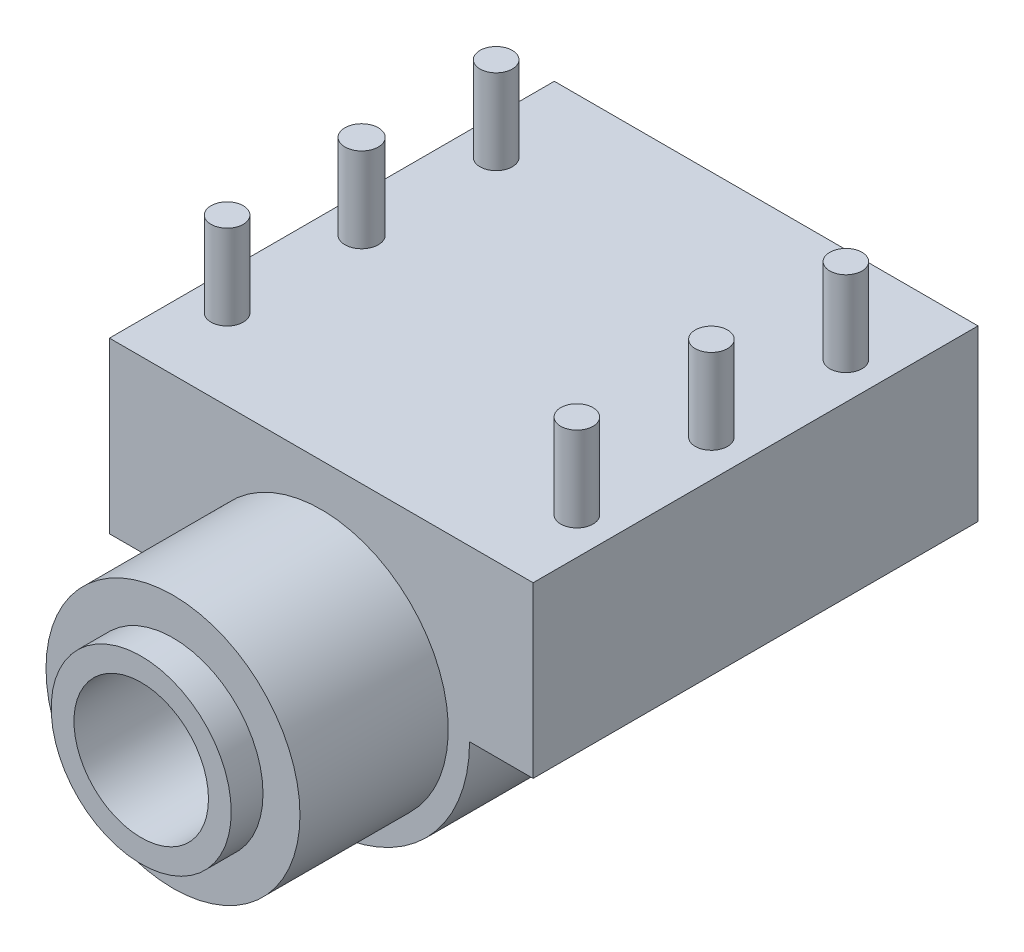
ISO-10303-21;
HEADER;
FILE_DESCRIPTION(('STEP AP214'),'2;1');
FILE_NAME('part.step','',(''),(''),'','','');
FILE_SCHEMA(('AUTOMOTIVE_DESIGN { 1 0 10303 214 1 1 1 1 }'));
ENDSEC;
DATA;
#1=APPLICATION_CONTEXT('core data for automotive mechanical design processes');
#2=APPLICATION_PROTOCOL_DEFINITION('international standard','automotive_design',2000,#1);
#3=PRODUCT_CONTEXT('',#1,'mechanical');
#4=PRODUCT('Part','Part','',(#3));
#5=PRODUCT_RELATED_PRODUCT_CATEGORY('part','',(#4));
#6=PRODUCT_DEFINITION_FORMATION('','',#4);
#7=PRODUCT_DEFINITION_CONTEXT('part definition',#1,'design');
#8=PRODUCT_DEFINITION('design','',#6,#7);
#9=PRODUCT_DEFINITION_SHAPE('','',#8);
#10=(LENGTH_UNIT() NAMED_UNIT(*) SI_UNIT(.MILLI.,.METRE.));
#11=(NAMED_UNIT(*) PLANE_ANGLE_UNIT() SI_UNIT($,.RADIAN.));
#12=(NAMED_UNIT(*) SI_UNIT($,.STERADIAN.) SOLID_ANGLE_UNIT());
#13=UNCERTAINTY_MEASURE_WITH_UNIT(LENGTH_MEASURE(1.E-05),#10,'distance_accuracy_value','');
#14=(GEOMETRIC_REPRESENTATION_CONTEXT(3) GLOBAL_UNCERTAINTY_ASSIGNED_CONTEXT((#13)) GLOBAL_UNIT_ASSIGNED_CONTEXT((#10,
#11,#12)) REPRESENTATION_CONTEXT('',''));
#15=CARTESIAN_POINT('',(0.,0.,0.));
#16=DIRECTION('',(0.,0.,1.));
#17=DIRECTION('',(1.,0.,0.));
#18=AXIS2_PLACEMENT_3D('',#15,#16,#17);
#19=CARTESIAN_POINT('',(0.,0.,7.));
#20=DIRECTION('',(0.,0.,1.));
#21=DIRECTION('',(1.,0.,0.));
#22=AXIS2_PLACEMENT_3D('',#19,#20,#21);
#23=PLANE('',#22);
#24=CARTESIAN_POINT('',(0.,0.,7.));
#25=DIRECTION('',(0.,0.,1.));
#26=DIRECTION('',(1.,0.,0.));
#27=AXIS2_PLACEMENT_3D('',#24,#25,#26);
#28=CIRCLE('',#27,5.9944);
#29=CARTESIAN_POINT('',(5.9944,0.,7.));
#30=VERTEX_POINT('',#29);
#31=EDGE_CURVE('E145',#30,#30,#28,.T.);
#32=ORIENTED_EDGE('',*,*,#31,.T.);
#33=EDGE_LOOP('',(#32));
#34=FACE_BOUND('',#33,.T.);
#35=CARTESIAN_POINT('',(0.,0.,7.));
#36=DIRECTION('',(0.,0.,1.));
#37=DIRECTION('',(1.,0.,0.));
#38=AXIS2_PLACEMENT_3D('',#35,#36,#37);
#39=CIRCLE('',#38,4.25);
#40=CARTESIAN_POINT('',(4.25,0.,7.));
#41=VERTEX_POINT('',#40);
#42=EDGE_CURVE('E275',#41,#41,#39,.T.);
#43=ORIENTED_EDGE('',*,*,#42,.F.);
#44=EDGE_LOOP('',(#43));
#45=FACE_BOUND('',#44,.T.);
#46=ADVANCED_FACE('F31',(#34,#45),#23,.T.);
#47=CARTESIAN_POINT('',(0.,0.,-21.));
#48=DIRECTION('',(0.,0.,-1.));
#49=DIRECTION('',(-1.,0.,0.));
#50=AXIS2_PLACEMENT_3D('',#47,#48,#49);
#51=PLANE('',#50);
#52=CARTESIAN_POINT('',(0.,0.,-21.));
#53=DIRECTION('',(0.,0.,-1.));
#54=DIRECTION('',(-1.,0.,0.));
#55=AXIS2_PLACEMENT_3D('',#52,#53,#54);
#56=CIRCLE('',#55,7.);
#57=CARTESIAN_POINT('',(7.,0.,-21.));
#58=VERTEX_POINT('',#57);
#59=CARTESIAN_POINT('',(-7.,0.,-21.));
#60=VERTEX_POINT('',#59);
#61=EDGE_CURVE('E51',#58,#60,#56,.T.);
#62=ORIENTED_EDGE('',*,*,#61,.T.);
#63=DIRECTION('',(1.,0.,0.));
#64=VECTOR('',#63,1.);
#65=CARTESIAN_POINT('',(10.,0.,-21.));
#66=LINE('',#65,#64);
#67=CARTESIAN_POINT('',(-10.,0.,-21.));
#68=VERTEX_POINT('',#67);
#69=EDGE_CURVE('E95',#68,#60,#66,.T.);
#70=ORIENTED_EDGE('',*,*,#69,.F.);
#71=DIRECTION('',(0.,-1.,0.));
#72=VECTOR('',#71,1.);
#73=CARTESIAN_POINT('',(-10.,0.,-21.));
#74=LINE('',#73,#72);
#75=CARTESIAN_POINT('',(-10.,8.,-21.));
#76=VERTEX_POINT('',#75);
#77=EDGE_CURVE('E106',#76,#68,#74,.T.);
#78=ORIENTED_EDGE('',*,*,#77,.F.);
#79=DIRECTION('',(-1.,0.,0.));
#80=VECTOR('',#79,1.);
#81=CARTESIAN_POINT('',(10.,8.,-21.));
#82=LINE('',#81,#80);
#83=CARTESIAN_POINT('',(10.,8.,-21.));
#84=VERTEX_POINT('',#83);
#85=EDGE_CURVE('E87',#84,#76,#82,.T.);
#86=ORIENTED_EDGE('',*,*,#85,.F.);
#87=DIRECTION('',(0.,1.,0.));
#88=VECTOR('',#87,1.);
#89=CARTESIAN_POINT('',(10.,0.,-21.));
#90=LINE('',#89,#88);
#91=CARTESIAN_POINT('',(10.,0.,-21.));
#92=VERTEX_POINT('',#91);
#93=EDGE_CURVE('E103',#92,#84,#90,.T.);
#94=ORIENTED_EDGE('',*,*,#93,.F.);
#95=EDGE_CURVE('E122',#58,#92,#66,.T.);
#96=ORIENTED_EDGE('',*,*,#95,.F.);
#97=EDGE_LOOP('',(#62,#70,#78,#86,#94,#96));
#98=FACE_BOUND('',#97,.T.);
#99=CARTESIAN_POINT('',(0.,0.,-21.));
#100=DIRECTION('',(0.,0.,-1.));
#101=DIRECTION('',(-1.,0.,0.));
#102=AXIS2_PLACEMENT_3D('',#99,#100,#101);
#103=CIRCLE('',#102,4.5);
#104=CARTESIAN_POINT('',(-4.5,0.,-21.));
#105=VERTEX_POINT('',#104);
#106=EDGE_CURVE('E285',#105,#105,#103,.T.);
#107=ORIENTED_EDGE('',*,*,#106,.F.);
#108=EDGE_LOOP('',(#107));
#109=FACE_BOUND('',#108,.T.);
#110=ADVANCED_FACE('F100',(#98,#109),#51,.T.);
#111=CARTESIAN_POINT('',(10.,8.,-21.));
#112=DIRECTION('',(0.,1.,0.));
#113=DIRECTION('',(0.,0.,1.));
#114=AXIS2_PLACEMENT_3D('',#111,#112,#113);
#115=PLANE('',#114);
#116=CARTESIAN_POINT('',(-8.255,8.,-3.81));
#117=DIRECTION('',(0.,1.,0.));
#118=DIRECTION('',(0.,0.,1.));
#119=AXIS2_PLACEMENT_3D('',#116,#117,#118);
#120=CIRCLE('',#119,0.761999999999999);
#121=CARTESIAN_POINT('',(-8.255,8.,-3.048));
#122=VERTEX_POINT('',#121);
#123=EDGE_CURVE('E293',#122,#122,#120,.T.);
#124=ORIENTED_EDGE('',*,*,#123,.F.);
#125=EDGE_LOOP('',(#124));
#126=FACE_BOUND('',#125,.T.);
#127=CARTESIAN_POINT('',(-8.255,8.,-10.16));
#128=DIRECTION('',(0.,1.,0.));
#129=DIRECTION('',(0.,0.,1.));
#130=AXIS2_PLACEMENT_3D('',#127,#128,#129);
#131=CIRCLE('',#130,0.787399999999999);
#132=CARTESIAN_POINT('',(-8.255,8.,-9.3726));
#133=VERTEX_POINT('',#132);
#134=EDGE_CURVE('E305',#133,#133,#131,.T.);
#135=ORIENTED_EDGE('',*,*,#134,.F.);
#136=EDGE_LOOP('',(#135));
#137=FACE_BOUND('',#136,.T.);
#138=CARTESIAN_POINT('',(-8.255,8.,-16.51));
#139=DIRECTION('',(0.,1.,0.));
#140=DIRECTION('',(0.,0.,1.));
#141=AXIS2_PLACEMENT_3D('',#138,#139,#140);
#142=CIRCLE('',#141,0.761999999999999);
#143=CARTESIAN_POINT('',(-8.255,8.,-15.748));
#144=VERTEX_POINT('',#143);
#145=EDGE_CURVE('E118',#144,#144,#142,.T.);
#146=ORIENTED_EDGE('',*,*,#145,.F.);
#147=EDGE_LOOP('',(#146));
#148=FACE_BOUND('',#147,.T.);
#149=DIRECTION('',(-1.,0.,0.));
#150=VECTOR('',#149,1.);
#151=CARTESIAN_POINT('',(10.,8.,0.));
#152=LINE('',#151,#150);
#153=CARTESIAN_POINT('',(10.,8.,0.));
#154=VERTEX_POINT('',#153);
#155=CARTESIAN_POINT('',(-10.,8.,0.));
#156=VERTEX_POINT('',#155);
#157=EDGE_CURVE('E89',#154,#156,#152,.T.);
#158=ORIENTED_EDGE('',*,*,#157,.F.);
#159=DIRECTION('',(0.,0.,1.));
#160=VECTOR('',#159,1.);
#161=CARTESIAN_POINT('',(10.,8.,-21.));
#162=LINE('',#161,#160);
#163=EDGE_CURVE('E83',#84,#154,#162,.T.);
#164=ORIENTED_EDGE('',*,*,#163,.F.);
#165=ORIENTED_EDGE('',*,*,#85,.T.);
#166=DIRECTION('',(0.,0.,1.));
#167=VECTOR('',#166,1.);
#168=CARTESIAN_POINT('',(-10.,8.,-21.));
#169=LINE('',#168,#167);
#170=EDGE_CURVE('E94',#76,#156,#169,.T.);
#171=ORIENTED_EDGE('',*,*,#170,.T.);
#172=EDGE_LOOP('',(#158,#164,#165,#171));
#173=FACE_BOUND('',#172,.T.);
#174=CARTESIAN_POINT('',(8.255,8.,-16.51));
#175=DIRECTION('',(0.,1.,0.));
#176=DIRECTION('',(0.,0.,1.));
#177=AXIS2_PLACEMENT_3D('',#174,#175,#176);
#178=CIRCLE('',#177,0.761999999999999);
#179=CARTESIAN_POINT('',(8.255,8.,-15.748));
#180=VERTEX_POINT('',#179);
#181=EDGE_CURVE('E311',#180,#180,#178,.T.);
#182=ORIENTED_EDGE('',*,*,#181,.F.);
#183=EDGE_LOOP('',(#182));
#184=FACE_BOUND('',#183,.T.);
#185=CARTESIAN_POINT('',(8.255,8.,-10.16));
#186=DIRECTION('',(0.,1.,0.));
#187=DIRECTION('',(0.,0.,1.));
#188=AXIS2_PLACEMENT_3D('',#185,#186,#187);
#189=CIRCLE('',#188,0.762000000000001);
#190=CARTESIAN_POINT('',(8.255,8.,-9.398));
#191=VERTEX_POINT('',#190);
#192=EDGE_CURVE('E299',#191,#191,#189,.T.);
#193=ORIENTED_EDGE('',*,*,#192,.F.);
#194=EDGE_LOOP('',(#193));
#195=FACE_BOUND('',#194,.T.);
#196=CARTESIAN_POINT('',(8.255,8.,-3.81));
#197=DIRECTION('',(0.,1.,0.));
#198=DIRECTION('',(0.,0.,1.));
#199=AXIS2_PLACEMENT_3D('',#196,#197,#198);
#200=CIRCLE('',#199,0.762000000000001);
#201=CARTESIAN_POINT('',(8.255,8.,-3.048));
#202=VERTEX_POINT('',#201);
#203=EDGE_CURVE('E289',#202,#202,#200,.T.);
#204=ORIENTED_EDGE('',*,*,#203,.F.);
#205=EDGE_LOOP('',(#204));
#206=FACE_BOUND('',#205,.T.);
#207=ADVANCED_FACE('F85',(#126,#137,#148,#173,#184,#195,#206),#115,.T.);
#208=CARTESIAN_POINT('',(0.,0.,7.));
#209=DIRECTION('',(0.,0.,-1.));
#210=DIRECTION('',(-1.,0.,0.));
#211=AXIS2_PLACEMENT_3D('',#208,#209,#210);
#212=CYLINDRICAL_SURFACE('',#211,5.9944);
#213=ORIENTED_EDGE('',*,*,#31,.F.);
#214=EDGE_LOOP('',(#213));
#215=FACE_BOUND('',#214,.T.);
#216=CARTESIAN_POINT('',(0.,0.,0.));
#217=DIRECTION('',(0.,0.,-1.));
#218=DIRECTION('',(-1.,0.,0.));
#219=AXIS2_PLACEMENT_3D('',#216,#217,#218);
#220=CIRCLE('',#219,5.9944);
#221=CARTESIAN_POINT('',(-5.9944,0.,0.));
#222=VERTEX_POINT('',#221);
#223=EDGE_CURVE('E141',#222,#222,#220,.T.);
#224=ORIENTED_EDGE('',*,*,#223,.F.);
#225=EDGE_LOOP('',(#224));
#226=FACE_BOUND('',#225,.T.);
#227=ADVANCED_FACE('F176',(#215,#226),#212,.T.);
#228=CARTESIAN_POINT('',(0.,0.,0.));
#229=DIRECTION('',(0.,0.,-1.));
#230=DIRECTION('',(-1.,0.,0.));
#231=AXIS2_PLACEMENT_3D('',#228,#229,#230);
#232=PLANE('',#231);
#233=ORIENTED_EDGE('',*,*,#223,.T.);
#234=EDGE_LOOP('',(#233));
#235=FACE_BOUND('',#234,.T.);
#236=CARTESIAN_POINT('',(0.,0.,0.));
#237=DIRECTION('',(0.,0.,-1.));
#238=DIRECTION('',(-1.,0.,0.));
#239=AXIS2_PLACEMENT_3D('',#236,#237,#238);
#240=CIRCLE('',#239,7.);
#241=CARTESIAN_POINT('',(7.,0.,0.));
#242=VERTEX_POINT('',#241);
#243=CARTESIAN_POINT('',(-7.,0.,0.));
#244=VERTEX_POINT('',#243);
#245=EDGE_CURVE('E46',#242,#244,#240,.T.);
#246=ORIENTED_EDGE('',*,*,#245,.F.);
#247=DIRECTION('',(1.,0.,0.));
#248=VECTOR('',#247,1.);
#249=CARTESIAN_POINT('',(10.,0.,0.));
#250=LINE('',#249,#248);
#251=CARTESIAN_POINT('',(10.,0.,0.));
#252=VERTEX_POINT('',#251);
#253=EDGE_CURVE('E115',#242,#252,#250,.T.);
#254=ORIENTED_EDGE('',*,*,#253,.T.);
#255=DIRECTION('',(0.,1.,0.));
#256=VECTOR('',#255,1.);
#257=CARTESIAN_POINT('',(10.,0.,0.));
#258=LINE('',#257,#256);
#259=EDGE_CURVE('E125',#252,#154,#258,.T.);
#260=ORIENTED_EDGE('',*,*,#259,.T.);
#261=ORIENTED_EDGE('',*,*,#157,.T.);
#262=DIRECTION('',(0.,-1.,0.));
#263=VECTOR('',#262,1.);
#264=CARTESIAN_POINT('',(-10.,0.,0.));
#265=LINE('',#264,#263);
#266=CARTESIAN_POINT('',(-10.,0.,0.));
#267=VERTEX_POINT('',#266);
#268=EDGE_CURVE('E129',#156,#267,#265,.T.);
#269=ORIENTED_EDGE('',*,*,#268,.T.);
#270=EDGE_CURVE('E112',#267,#244,#250,.T.);
#271=ORIENTED_EDGE('',*,*,#270,.T.);
#272=EDGE_LOOP('',(#246,#254,#260,#261,#269,#271));
#273=FACE_BOUND('',#272,.T.);
#274=ADVANCED_FACE('F178',(#235,#273),#232,.F.);
#275=CARTESIAN_POINT('',(0.,0.,-21.));
#276=DIRECTION('',(0.,0.,1.));
#277=DIRECTION('',(1.,0.,0.));
#278=AXIS2_PLACEMENT_3D('',#275,#276,#277);
#279=CYLINDRICAL_SURFACE('',#278,7.);
#280=ORIENTED_EDGE('',*,*,#61,.F.);
#281=DIRECTION('',(0.,0.,1.));
#282=VECTOR('',#281,1.);
#283=CARTESIAN_POINT('',(7.,0.,-21.));
#284=LINE('',#283,#282);
#285=EDGE_CURVE('E138',#58,#242,#284,.T.);
#286=ORIENTED_EDGE('',*,*,#285,.T.);
#287=ORIENTED_EDGE('',*,*,#245,.T.);
#288=DIRECTION('',(0.,0.,1.));
#289=VECTOR('',#288,1.);
#290=CARTESIAN_POINT('',(-7.,0.,-21.));
#291=LINE('',#290,#289);
#292=EDGE_CURVE('E133',#244,#60,#291,.F.);
#293=ORIENTED_EDGE('',*,*,#292,.T.);
#294=EDGE_LOOP('',(#280,#286,#287,#293));
#295=FACE_BOUND('',#294,.T.);
#296=ADVANCED_FACE('F174',(#295),#279,.T.);
#297=CARTESIAN_POINT('',(10.,0.,-21.));
#298=DIRECTION('',(0.,-1.,0.));
#299=DIRECTION('',(0.,0.,-1.));
#300=AXIS2_PLACEMENT_3D('',#297,#298,#299);
#301=PLANE('',#300);
#302=ORIENTED_EDGE('',*,*,#285,.F.);
#303=ORIENTED_EDGE('',*,*,#95,.T.);
#304=DIRECTION('',(0.,0.,1.));
#305=VECTOR('',#304,1.);
#306=CARTESIAN_POINT('',(10.,0.,-21.));
#307=LINE('',#306,#305);
#308=EDGE_CURVE('E111',#92,#252,#307,.T.);
#309=ORIENTED_EDGE('',*,*,#308,.T.);
#310=ORIENTED_EDGE('',*,*,#253,.F.);
#311=EDGE_LOOP('',(#302,#303,#309,#310));
#312=FACE_BOUND('',#311,.T.);
#313=ADVANCED_FACE('F194',(#312),#301,.T.);
#314=ORIENTED_EDGE('',*,*,#292,.F.);
#315=ORIENTED_EDGE('',*,*,#270,.F.);
#316=DIRECTION('',(0.,0.,1.));
#317=VECTOR('',#316,1.);
#318=CARTESIAN_POINT('',(-10.,0.,-21.));
#319=LINE('',#318,#317);
#320=EDGE_CURVE('E134',#68,#267,#319,.T.);
#321=ORIENTED_EDGE('',*,*,#320,.F.);
#322=ORIENTED_EDGE('',*,*,#69,.T.);
#323=EDGE_LOOP('',(#314,#315,#321,#322));
#324=FACE_BOUND('',#323,.T.);
#325=ADVANCED_FACE('F198',(#324),#301,.T.);
#326=CARTESIAN_POINT('',(10.,0.,-21.));
#327=DIRECTION('',(1.,0.,0.));
#328=DIRECTION('',(0.,0.,-1.));
#329=AXIS2_PLACEMENT_3D('',#326,#327,#328);
#330=PLANE('',#329);
#331=ORIENTED_EDGE('',*,*,#259,.F.);
#332=ORIENTED_EDGE('',*,*,#308,.F.);
#333=ORIENTED_EDGE('',*,*,#93,.T.);
#334=ORIENTED_EDGE('',*,*,#163,.T.);
#335=EDGE_LOOP('',(#331,#332,#333,#334));
#336=FACE_BOUND('',#335,.T.);
#337=ADVANCED_FACE('F109',(#336),#330,.T.);
#338=CARTESIAN_POINT('',(-10.,0.,-21.));
#339=DIRECTION('',(-1.,0.,0.));
#340=DIRECTION('',(0.,0.,1.));
#341=AXIS2_PLACEMENT_3D('',#338,#339,#340);
#342=PLANE('',#341);
#343=ORIENTED_EDGE('',*,*,#268,.F.);
#344=ORIENTED_EDGE('',*,*,#170,.F.);
#345=ORIENTED_EDGE('',*,*,#77,.T.);
#346=ORIENTED_EDGE('',*,*,#320,.T.);
#347=EDGE_LOOP('',(#343,#344,#345,#346));
#348=FACE_BOUND('',#347,.T.);
#349=ADVANCED_FACE('F199',(#348),#342,.T.);
#350=CARTESIAN_POINT('',(-8.255,12.,-16.51));
#351=DIRECTION('',(0.,-1.,0.));
#352=DIRECTION('',(0.,0.,-1.));
#353=AXIS2_PLACEMENT_3D('',#350,#351,#352);
#354=CYLINDRICAL_SURFACE('',#353,0.761999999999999);
#355=CARTESIAN_POINT('',(-8.255,12.,-16.51));
#356=DIRECTION('',(0.,1.,0.));
#357=DIRECTION('',(0.,0.,1.));
#358=AXIS2_PLACEMENT_3D('',#355,#356,#357);
#359=CIRCLE('',#358,0.761999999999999);
#360=CARTESIAN_POINT('',(-8.255,12.,-15.748));
#361=VERTEX_POINT('',#360);
#362=EDGE_CURVE('E127',#361,#361,#359,.T.);
#363=ORIENTED_EDGE('',*,*,#362,.F.);
#364=EDGE_LOOP('',(#363));
#365=FACE_BOUND('',#364,.T.);
#366=ORIENTED_EDGE('',*,*,#145,.T.);
#367=EDGE_LOOP('',(#366));
#368=FACE_BOUND('',#367,.T.);
#369=ADVANCED_FACE('F201',(#365,#368),#354,.T.);
#370=CARTESIAN_POINT('',(-8.255,12.,-16.51));
#371=DIRECTION('',(0.,1.,0.));
#372=DIRECTION('',(0.,0.,1.));
#373=AXIS2_PLACEMENT_3D('',#370,#371,#372);
#374=PLANE('',#373);
#375=ORIENTED_EDGE('',*,*,#362,.T.);
#376=EDGE_LOOP('',(#375));
#377=FACE_BOUND('',#376,.T.);
#378=ADVANCED_FACE('F207',(#377),#374,.T.);
#379=CARTESIAN_POINT('',(8.255,12.,-16.51));
#380=DIRECTION('',(0.,-1.,0.));
#381=DIRECTION('',(0.,0.,-1.));
#382=AXIS2_PLACEMENT_3D('',#379,#380,#381);
#383=CYLINDRICAL_SURFACE('',#382,0.761999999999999);
#384=CARTESIAN_POINT('',(8.255,12.,-16.51));
#385=DIRECTION('',(0.,1.,0.));
#386=DIRECTION('',(0.,0.,1.));
#387=AXIS2_PLACEMENT_3D('',#384,#385,#386);
#388=CIRCLE('',#387,0.761999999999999);
#389=CARTESIAN_POINT('',(8.255,12.,-15.748));
#390=VERTEX_POINT('',#389);
#391=EDGE_CURVE('E314',#390,#390,#388,.T.);
#392=ORIENTED_EDGE('',*,*,#391,.F.);
#393=EDGE_LOOP('',(#392));
#394=FACE_BOUND('',#393,.T.);
#395=ORIENTED_EDGE('',*,*,#181,.T.);
#396=EDGE_LOOP('',(#395));
#397=FACE_BOUND('',#396,.T.);
#398=ADVANCED_FACE('F216',(#394,#397),#383,.T.);
#399=CARTESIAN_POINT('',(8.255,12.,-16.51));
#400=DIRECTION('',(0.,1.,0.));
#401=DIRECTION('',(0.,0.,1.));
#402=AXIS2_PLACEMENT_3D('',#399,#400,#401);
#403=PLANE('',#402);
#404=ORIENTED_EDGE('',*,*,#391,.T.);
#405=EDGE_LOOP('',(#404));
#406=FACE_BOUND('',#405,.T.);
#407=ADVANCED_FACE('F220',(#406),#403,.T.);
#408=CARTESIAN_POINT('',(-8.255,12.,-10.16));
#409=DIRECTION('',(0.,-1.,0.));
#410=DIRECTION('',(0.,0.,-1.));
#411=AXIS2_PLACEMENT_3D('',#408,#409,#410);
#412=CYLINDRICAL_SURFACE('',#411,0.787399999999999);
#413=CARTESIAN_POINT('',(-8.255,12.,-10.16));
#414=DIRECTION('',(0.,1.,0.));
#415=DIRECTION('',(0.,0.,1.));
#416=AXIS2_PLACEMENT_3D('',#413,#414,#415);
#417=CIRCLE('',#416,0.787399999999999);
#418=CARTESIAN_POINT('',(-8.255,12.,-9.3726));
#419=VERTEX_POINT('',#418);
#420=EDGE_CURVE('E308',#419,#419,#417,.T.);
#421=ORIENTED_EDGE('',*,*,#420,.F.);
#422=EDGE_LOOP('',(#421));
#423=FACE_BOUND('',#422,.T.);
#424=ORIENTED_EDGE('',*,*,#134,.T.);
#425=EDGE_LOOP('',(#424));
#426=FACE_BOUND('',#425,.T.);
#427=ADVANCED_FACE('F224',(#423,#426),#412,.T.);
#428=CARTESIAN_POINT('',(-8.255,12.,-10.16));
#429=DIRECTION('',(0.,1.,0.));
#430=DIRECTION('',(0.,0.,1.));
#431=AXIS2_PLACEMENT_3D('',#428,#429,#430);
#432=PLANE('',#431);
#433=ORIENTED_EDGE('',*,*,#420,.T.);
#434=EDGE_LOOP('',(#433));
#435=FACE_BOUND('',#434,.T.);
#436=ADVANCED_FACE('F228',(#435),#432,.T.);
#437=CARTESIAN_POINT('',(8.255,12.,-10.16));
#438=DIRECTION('',(0.,-1.,0.));
#439=DIRECTION('',(0.,0.,-1.));
#440=AXIS2_PLACEMENT_3D('',#437,#438,#439);
#441=CYLINDRICAL_SURFACE('',#440,0.762000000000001);
#442=CARTESIAN_POINT('',(8.255,12.,-10.16));
#443=DIRECTION('',(0.,1.,0.));
#444=DIRECTION('',(0.,0.,1.));
#445=AXIS2_PLACEMENT_3D('',#442,#443,#444);
#446=CIRCLE('',#445,0.762000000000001);
#447=CARTESIAN_POINT('',(8.255,12.,-9.398));
#448=VERTEX_POINT('',#447);
#449=EDGE_CURVE('E302',#448,#448,#446,.T.);
#450=ORIENTED_EDGE('',*,*,#449,.F.);
#451=EDGE_LOOP('',(#450));
#452=FACE_BOUND('',#451,.T.);
#453=ORIENTED_EDGE('',*,*,#192,.T.);
#454=EDGE_LOOP('',(#453));
#455=FACE_BOUND('',#454,.T.);
#456=ADVANCED_FACE('F232',(#452,#455),#441,.T.);
#457=CARTESIAN_POINT('',(8.255,12.,-10.16));
#458=DIRECTION('',(0.,1.,0.));
#459=DIRECTION('',(0.,0.,1.));
#460=AXIS2_PLACEMENT_3D('',#457,#458,#459);
#461=PLANE('',#460);
#462=ORIENTED_EDGE('',*,*,#449,.T.);
#463=EDGE_LOOP('',(#462));
#464=FACE_BOUND('',#463,.T.);
#465=ADVANCED_FACE('F236',(#464),#461,.T.);
#466=CARTESIAN_POINT('',(-8.255,12.,-3.81));
#467=DIRECTION('',(0.,-1.,0.));
#468=DIRECTION('',(0.,0.,-1.));
#469=AXIS2_PLACEMENT_3D('',#466,#467,#468);
#470=CYLINDRICAL_SURFACE('',#469,0.761999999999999);
#471=CARTESIAN_POINT('',(-8.255,12.,-3.81));
#472=DIRECTION('',(0.,1.,0.));
#473=DIRECTION('',(0.,0.,1.));
#474=AXIS2_PLACEMENT_3D('',#471,#472,#473);
#475=CIRCLE('',#474,0.761999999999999);
#476=CARTESIAN_POINT('',(-8.255,12.,-3.048));
#477=VERTEX_POINT('',#476);
#478=EDGE_CURVE('E296',#477,#477,#475,.T.);
#479=ORIENTED_EDGE('',*,*,#478,.F.);
#480=EDGE_LOOP('',(#479));
#481=FACE_BOUND('',#480,.T.);
#482=ORIENTED_EDGE('',*,*,#123,.T.);
#483=EDGE_LOOP('',(#482));
#484=FACE_BOUND('',#483,.T.);
#485=ADVANCED_FACE('F240',(#481,#484),#470,.T.);
#486=CARTESIAN_POINT('',(-8.255,12.,-3.81));
#487=DIRECTION('',(0.,1.,0.));
#488=DIRECTION('',(0.,0.,1.));
#489=AXIS2_PLACEMENT_3D('',#486,#487,#488);
#490=PLANE('',#489);
#491=ORIENTED_EDGE('',*,*,#478,.T.);
#492=EDGE_LOOP('',(#491));
#493=FACE_BOUND('',#492,.T.);
#494=ADVANCED_FACE('F244',(#493),#490,.T.);
#495=CARTESIAN_POINT('',(8.255,12.,-3.81));
#496=DIRECTION('',(0.,-1.,0.));
#497=DIRECTION('',(0.,0.,-1.));
#498=AXIS2_PLACEMENT_3D('',#495,#496,#497);
#499=CYLINDRICAL_SURFACE('',#498,0.762000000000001);
#500=CARTESIAN_POINT('',(8.255,12.,-3.81));
#501=DIRECTION('',(0.,1.,0.));
#502=DIRECTION('',(0.,0.,1.));
#503=AXIS2_PLACEMENT_3D('',#500,#501,#502);
#504=CIRCLE('',#503,0.762000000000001);
#505=CARTESIAN_POINT('',(8.255,12.,-3.048));
#506=VERTEX_POINT('',#505);
#507=EDGE_CURVE('E290',#506,#506,#504,.T.);
#508=ORIENTED_EDGE('',*,*,#507,.F.);
#509=EDGE_LOOP('',(#508));
#510=FACE_BOUND('',#509,.T.);
#511=ORIENTED_EDGE('',*,*,#203,.T.);
#512=EDGE_LOOP('',(#511));
#513=FACE_BOUND('',#512,.T.);
#514=ADVANCED_FACE('F248',(#510,#513),#499,.T.);
#515=CARTESIAN_POINT('',(8.255,12.,-3.81));
#516=DIRECTION('',(0.,1.,0.));
#517=DIRECTION('',(0.,0.,1.));
#518=AXIS2_PLACEMENT_3D('',#515,#516,#517);
#519=PLANE('',#518);
#520=ORIENTED_EDGE('',*,*,#507,.T.);
#521=EDGE_LOOP('',(#520));
#522=FACE_BOUND('',#521,.T.);
#523=ADVANCED_FACE('F252',(#522),#519,.T.);
#524=CARTESIAN_POINT('',(0.,0.,-24.));
#525=DIRECTION('',(0.,0.,1.));
#526=DIRECTION('',(1.,0.,0.));
#527=AXIS2_PLACEMENT_3D('',#524,#525,#526);
#528=CYLINDRICAL_SURFACE('',#527,4.5);
#529=CARTESIAN_POINT('',(0.,0.,-23.7));
#530=DIRECTION('',(0.,0.,-1.));
#531=DIRECTION('',(-1.,0.,0.));
#532=AXIS2_PLACEMENT_3D('',#529,#530,#531);
#533=CIRCLE('',#532,4.5);
#534=CARTESIAN_POINT('',(4.50000000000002,0.,-23.7));
#535=VERTEX_POINT('',#534);
#536=EDGE_CURVE('E11',#535,#535,#533,.F.);
#537=ORIENTED_EDGE('',*,*,#536,.T.);
#538=EDGE_LOOP('',(#537));
#539=FACE_BOUND('',#538,.T.);
#540=ORIENTED_EDGE('',*,*,#106,.T.);
#541=EDGE_LOOP('',(#540));
#542=FACE_BOUND('',#541,.T.);
#543=ADVANCED_FACE('F162',(#539,#542),#528,.T.);
#544=CARTESIAN_POINT('',(0.,0.,-24.));
#545=DIRECTION('',(0.,0.,-1.));
#546=DIRECTION('',(-1.,0.,0.));
#547=AXIS2_PLACEMENT_3D('',#544,#545,#546);
#548=PLANE('',#547);
#549=CARTESIAN_POINT('',(0.,0.,-24.));
#550=DIRECTION('',(0.,0.,-1.));
#551=DIRECTION('',(-1.,0.,0.));
#552=AXIS2_PLACEMENT_3D('',#549,#550,#551);
#553=CIRCLE('',#552,1.07098430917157);
#554=CARTESIAN_POINT('',(1.07098430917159,0.,-24.));
#555=VERTEX_POINT('',#554);
#556=EDGE_CURVE('E39',#555,#555,#553,.T.);
#557=ORIENTED_EDGE('',*,*,#556,.T.);
#558=EDGE_LOOP('',(#557));
#559=FACE_BOUND('',#558,.T.);
#560=ADVANCED_FACE('F150',(#559),#548,.T.);
#561=CARTESIAN_POINT('',(0.,0.,-24.));
#562=DIRECTION('',(0.,0.,1.));
#563=DIRECTION('',(1.,0.,0.));
#564=AXIS2_PLACEMENT_3D('',#561,#562,#563);
#565=CONICAL_SURFACE('',#564,1.07098430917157,1.48352986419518);
#566=CARTESIAN_POINT('',(4.50000000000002,0.,-23.7));
#567=CARTESIAN_POINT('',(4.46428108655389,0.,-23.703125));
#568=CARTESIAN_POINT('',(4.42856217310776,0.,-23.70625));
#569=CARTESIAN_POINT('',(4.3571243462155,0.,-23.7125));
#570=CARTESIAN_POINT('',(4.32140543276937,0.,-23.715625));
#571=CARTESIAN_POINT('',(4.24996760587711,0.,-23.721875));
#572=CARTESIAN_POINT('',(4.21424869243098,0.,-23.725));
#573=CARTESIAN_POINT('',(4.14281086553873,0.,-23.73125));
#574=CARTESIAN_POINT('',(4.1070919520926,0.,-23.734375));
#575=CARTESIAN_POINT('',(4.03565412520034,0.,-23.740625));
#576=CARTESIAN_POINT('',(3.99993521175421,0.,-23.74375));
#577=CARTESIAN_POINT('',(3.92849738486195,0.,-23.75));
#578=CARTESIAN_POINT('',(3.89277847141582,0.,-23.753125));
#579=CARTESIAN_POINT('',(3.82134064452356,0.,-23.759375));
#580=CARTESIAN_POINT('',(3.78562173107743,0.,-23.7625));
#581=CARTESIAN_POINT('',(3.71418390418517,0.,-23.76875));
#582=CARTESIAN_POINT('',(3.67846499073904,0.,-23.771875));
#583=CARTESIAN_POINT('',(3.60702716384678,0.,-23.778125));
#584=CARTESIAN_POINT('',(3.57130825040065,0.,-23.78125));
#585=CARTESIAN_POINT('',(3.4998704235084,0.,-23.7875));
#586=CARTESIAN_POINT('',(3.46415151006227,0.,-23.790625));
#587=CARTESIAN_POINT('',(3.39271368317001,0.,-23.796875));
#588=CARTESIAN_POINT('',(3.35699476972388,0.,-23.8));
#589=CARTESIAN_POINT('',(3.28555694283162,0.,-23.80625));
#590=CARTESIAN_POINT('',(3.24983802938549,0.,-23.809375));
#591=CARTESIAN_POINT('',(3.17840020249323,0.,-23.815625));
#592=CARTESIAN_POINT('',(3.1426812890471,0.,-23.81875));
#593=CARTESIAN_POINT('',(3.07124346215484,0.,-23.825));
#594=CARTESIAN_POINT('',(3.03552454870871,0.,-23.828125));
#595=CARTESIAN_POINT('',(2.96408672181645,0.,-23.834375));
#596=CARTESIAN_POINT('',(2.92836780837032,0.,-23.8375));
#597=CARTESIAN_POINT('',(2.85692998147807,0.,-23.84375));
#598=CARTESIAN_POINT('',(2.82121106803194,0.,-23.846875));
#599=CARTESIAN_POINT('',(2.74977324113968,0.,-23.853125));
#600=CARTESIAN_POINT('',(2.71405432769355,0.,-23.85625));
#601=CARTESIAN_POINT('',(2.64261650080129,0.,-23.8625));
#602=CARTESIAN_POINT('',(2.60689758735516,0.,-23.865625));
#603=CARTESIAN_POINT('',(2.5354597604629,0.,-23.871875));
#604=CARTESIAN_POINT('',(2.49974084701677,0.,-23.875));
#605=CARTESIAN_POINT('',(2.42830302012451,0.,-23.88125));
#606=CARTESIAN_POINT('',(2.39258410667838,0.,-23.884375));
#607=CARTESIAN_POINT('',(2.32114627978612,0.,-23.890625));
#608=CARTESIAN_POINT('',(2.28542736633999,0.,-23.89375));
#609=CARTESIAN_POINT('',(2.21398953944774,0.,-23.9));
#610=CARTESIAN_POINT('',(2.17827062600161,0.,-23.903125));
#611=CARTESIAN_POINT('',(2.10683279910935,0.,-23.909375));
#612=CARTESIAN_POINT('',(2.07111388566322,0.,-23.9125));
#613=CARTESIAN_POINT('',(1.99967605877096,0.,-23.91875));
#614=CARTESIAN_POINT('',(1.96395714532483,0.,-23.921875));
#615=CARTESIAN_POINT('',(1.89251931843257,0.,-23.928125));
#616=CARTESIAN_POINT('',(1.85680040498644,0.,-23.93125));
#617=CARTESIAN_POINT('',(1.78536257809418,0.,-23.9375));
#618=CARTESIAN_POINT('',(1.74964366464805,0.,-23.940625));
#619=CARTESIAN_POINT('',(1.67820583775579,0.,-23.946875));
#620=CARTESIAN_POINT('',(1.64248692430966,0.,-23.95));
#621=CARTESIAN_POINT('',(1.57104909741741,0.,-23.95625));
#622=CARTESIAN_POINT('',(1.53533018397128,0.,-23.959375));
#623=CARTESIAN_POINT('',(1.46389235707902,0.,-23.965625));
#624=CARTESIAN_POINT('',(1.42817344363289,0.,-23.96875));
#625=CARTESIAN_POINT('',(1.35673561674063,0.,-23.975));
#626=CARTESIAN_POINT('',(1.3210167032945,0.,-23.978125));
#627=CARTESIAN_POINT('',(1.24957887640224,0.,-23.984375));
#628=CARTESIAN_POINT('',(1.21385996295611,0.,-23.9875));
#629=CARTESIAN_POINT('',(1.14242213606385,0.,-23.99375));
#630=CARTESIAN_POINT('',(1.10670322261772,0.,-23.996875));
#631=CARTESIAN_POINT('',(1.07098430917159,0.,-24.));
#632=B_SPLINE_CURVE_WITH_KNOTS('',3,(#566,#567,#568,#569,#570,#571,#572,#573,#574,#575,#576,
#577,#578,#579,#580,#581,#582,#583,#584,#585,#586,#587,#588,#589,#590,#591,#592,#593,#594,#595,
#596,#597,#598,#599,#600,#601,#602,#603,#604,#605,#606,#607,#608,#609,#610,#611,#612,#613,#614,
#615,#616,#617,#618,#619,#620,#621,#622,#623,#624,#625,#626,#627,#628,#629,#630,#631),
.UNSPECIFIED.,.F.,.F.,(4,2,2,2,2,2,2,2,2,2,2,2,2,2,2,2,2,2,2,2,2,2,2,2,2,2,2,2,2,2,2,2,4),(0.,
0.107566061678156,0.215132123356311,0.322698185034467,0.430264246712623,0.537830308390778,
0.645396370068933,0.752962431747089,0.860528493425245,0.9680945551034,1.07566061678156,
1.18322667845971,1.29079274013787,1.39835880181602,1.50592486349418,1.61349092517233,
1.72105698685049,1.82862304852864,1.9361891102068,2.04375517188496,2.15132123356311,
2.25888729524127,2.36645335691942,2.47401941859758,2.58158548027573,2.68915154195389,
2.79671760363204,2.9042836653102,3.01184972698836,3.11941578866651,3.22698185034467,
3.33454791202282,3.44211397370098),.UNSPECIFIED.);
#633=EDGE_CURVE('BSEAM33',#535,#555,#632,.T.);
#634=ORIENTED_EDGE('',*,*,#536,.F.);
#635=ORIENTED_EDGE('',*,*,#556,.F.);
#636=ORIENTED_EDGE('',*,*,#633,.T.);
#637=ORIENTED_EDGE('',*,*,#633,.F.);
#638=EDGE_LOOP('',(#634,#636,#635,#637));
#639=FACE_BOUND('',#638,.T.);
#640=ADVANCED_FACE('F33',(#639),#565,.T.);
#641=CARTESIAN_POINT('',(0.,0.,8.5));
#642=DIRECTION('',(0.,0.,-1.));
#643=DIRECTION('',(-1.,0.,0.));
#644=AXIS2_PLACEMENT_3D('',#641,#642,#643);
#645=CYLINDRICAL_SURFACE('',#644,4.25);
#646=CARTESIAN_POINT('',(0.,0.,8.5));
#647=DIRECTION('',(0.,0.,1.));
#648=DIRECTION('',(1.,0.,0.));
#649=AXIS2_PLACEMENT_3D('',#646,#647,#648);
#650=CIRCLE('',#649,4.25);
#651=CARTESIAN_POINT('',(4.25,0.,8.5));
#652=VERTEX_POINT('',#651);
#653=EDGE_CURVE('E279',#652,#652,#650,.T.);
#654=ORIENTED_EDGE('',*,*,#653,.F.);
#655=EDGE_LOOP('',(#654));
#656=FACE_BOUND('',#655,.T.);
#657=ORIENTED_EDGE('',*,*,#42,.T.);
#658=EDGE_LOOP('',(#657));
#659=FACE_BOUND('',#658,.T.);
#660=ADVANCED_FACE('F153',(#656,#659),#645,.T.);
#661=CARTESIAN_POINT('',(0.,0.,8.5));
#662=DIRECTION('',(0.,0.,1.));
#663=DIRECTION('',(1.,0.,0.));
#664=AXIS2_PLACEMENT_3D('',#661,#662,#663);
#665=PLANE('',#664);
#666=CARTESIAN_POINT('',(0.,0.,8.5));
#667=DIRECTION('',(0.,0.,1.));
#668=DIRECTION('',(1.,0.,0.));
#669=AXIS2_PLACEMENT_3D('',#666,#667,#668);
#670=CIRCLE('',#669,3.175);
#671=CARTESIAN_POINT('',(3.175,0.,8.5));
#672=VERTEX_POINT('',#671);
#673=EDGE_CURVE('E276',#672,#672,#670,.T.);
#674=ORIENTED_EDGE('',*,*,#673,.F.);
#675=EDGE_LOOP('',(#674));
#676=FACE_BOUND('',#675,.T.);
#677=ORIENTED_EDGE('',*,*,#653,.T.);
#678=EDGE_LOOP('',(#677));
#679=FACE_BOUND('',#678,.T.);
#680=ADVANCED_FACE('F159',(#676,#679),#665,.T.);
#681=CARTESIAN_POINT('',(0.,0.,-23.5));
#682=DIRECTION('',(0.,0.,1.));
#683=DIRECTION('',(1.,0.,0.));
#684=AXIS2_PLACEMENT_3D('',#681,#682,#683);
#685=CYLINDRICAL_SURFACE('',#684,3.175);
#686=CARTESIAN_POINT('',(0.,0.,-23.5));
#687=DIRECTION('',(0.,0.,1.));
#688=DIRECTION('',(1.,0.,0.));
#689=AXIS2_PLACEMENT_3D('',#686,#687,#688);
#690=CIRCLE('',#689,3.175);
#691=CARTESIAN_POINT('',(3.175,0.,-23.5));
#692=VERTEX_POINT('',#691);
#693=EDGE_CURVE('E274',#692,#692,#690,.T.);
#694=ORIENTED_EDGE('',*,*,#693,.F.);
#695=EDGE_LOOP('',(#694));
#696=FACE_BOUND('',#695,.T.);
#697=ORIENTED_EDGE('',*,*,#673,.T.);
#698=EDGE_LOOP('',(#697));
#699=FACE_BOUND('',#698,.T.);
#700=ADVANCED_FACE('F262',(#696,#699),#685,.F.);
#701=CARTESIAN_POINT('',(0.,0.,-23.5));
#702=DIRECTION('',(0.,0.,1.));
#703=DIRECTION('',(1.,0.,0.));
#704=AXIS2_PLACEMENT_3D('',#701,#702,#703);
#705=PLANE('',#704);
#706=ORIENTED_EDGE('',*,*,#693,.T.);
#707=EDGE_LOOP('',(#706));
#708=FACE_BOUND('',#707,.T.);
#709=ADVANCED_FACE('F266',(#708),#705,.T.);
#710=CLOSED_SHELL('',(#46,#110,#207,#227,#274,#296,#313,#325,#337,#349,#369,#378,#398,#407,#427,
#436,#456,#465,#485,#494,#514,#523,#543,#560,#640,#660,#680,#700,#709));
#711=MANIFOLD_SOLID_BREP('B2',#710);
#712=ADVANCED_BREP_SHAPE_REPRESENTATION('',(#18,#711),#14);
#713=SHAPE_DEFINITION_REPRESENTATION(#9,#712);
ENDSEC;
END-ISO-10303-21;
